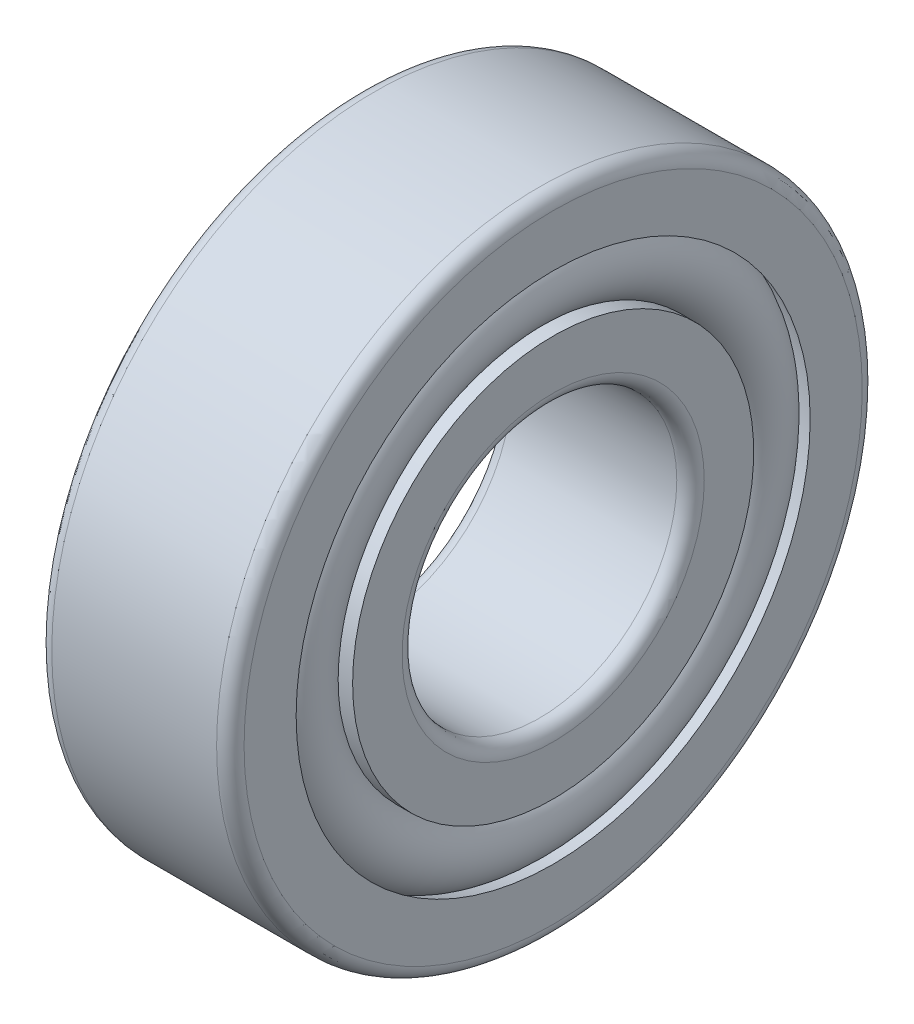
ISO-10303-21;
HEADER;
FILE_DESCRIPTION(('STEP AP214'),'2;1');
FILE_NAME('part.step','',(''),(''),'','','');
FILE_SCHEMA(('AUTOMOTIVE_DESIGN { 1 0 10303 214 1 1 1 1 }'));
ENDSEC;
DATA;
#1=APPLICATION_CONTEXT('core data for automotive mechanical design processes');
#2=APPLICATION_PROTOCOL_DEFINITION('international standard','automotive_design',2000,#1);
#3=PRODUCT_CONTEXT('',#1,'mechanical');
#4=PRODUCT('Part','Part','',(#3));
#5=PRODUCT_RELATED_PRODUCT_CATEGORY('part','',(#4));
#6=PRODUCT_DEFINITION_FORMATION('','',#4);
#7=PRODUCT_DEFINITION_CONTEXT('part definition',#1,'design');
#8=PRODUCT_DEFINITION('design','',#6,#7);
#9=PRODUCT_DEFINITION_SHAPE('','',#8);
#10=(LENGTH_UNIT() NAMED_UNIT(*) SI_UNIT(.MILLI.,.METRE.));
#11=(NAMED_UNIT(*) PLANE_ANGLE_UNIT() SI_UNIT($,.RADIAN.));
#12=(NAMED_UNIT(*) SI_UNIT($,.STERADIAN.) SOLID_ANGLE_UNIT());
#13=UNCERTAINTY_MEASURE_WITH_UNIT(LENGTH_MEASURE(1.E-05),#10,'distance_accuracy_value','');
#14=(GEOMETRIC_REPRESENTATION_CONTEXT(3) GLOBAL_UNCERTAINTY_ASSIGNED_CONTEXT((#13)) GLOBAL_UNIT_ASSIGNED_CONTEXT((#10,
#11,#12)) REPRESENTATION_CONTEXT('',''));
#15=CARTESIAN_POINT('',(0.,0.,0.));
#16=DIRECTION('',(0.,0.,1.));
#17=DIRECTION('',(1.,0.,0.));
#18=AXIS2_PLACEMENT_3D('',#15,#16,#17);
#19=CARTESIAN_POINT('',(1.,0.,0.));
#20=DIRECTION('',(1.,0.,0.));
#21=DIRECTION('',(0.,0.,-1.));
#22=AXIS2_PLACEMENT_3D('',#19,#20,#21);
#23=TOROIDAL_SURFACE('',#22,11.,1.);
#24=CARTESIAN_POINT('',(0.,0.,0.));
#25=DIRECTION('',(-1.,0.,0.));
#26=DIRECTION('',(0.,0.,-1.));
#27=AXIS2_PLACEMENT_3D('',#24,#25,#26);
#28=CIRCLE('',#27,11.);
#29=CARTESIAN_POINT('',(0.,0.,-11.));
#30=VERTEX_POINT('',#29);
#31=EDGE_CURVE('E160',#30,#30,#28,.F.);
#32=ORIENTED_EDGE('',*,*,#31,.F.);
#33=EDGE_LOOP('',(#32));
#34=FACE_BOUND('',#33,.T.);
#35=CARTESIAN_POINT('',(1.,0.,0.));
#36=DIRECTION('',(-1.,0.,0.));
#37=DIRECTION('',(0.,0.,1.));
#38=AXIS2_PLACEMENT_3D('',#35,#36,#37);
#39=CIRCLE('',#38,10.);
#40=CARTESIAN_POINT('',(1.,0.,10.));
#41=VERTEX_POINT('',#40);
#42=EDGE_CURVE('E164',#41,#41,#39,.F.);
#43=ORIENTED_EDGE('',*,*,#42,.T.);
#44=EDGE_LOOP('',(#43));
#45=FACE_BOUND('',#44,.T.);
#46=ADVANCED_FACE('F14',(#34,#45),#23,.T.);
#47=CARTESIAN_POINT('',(13.,0.,0.));
#48=DIRECTION('',(-1.,0.,0.));
#49=DIRECTION('',(0.,0.,1.));
#50=AXIS2_PLACEMENT_3D('',#47,#48,#49);
#51=CYLINDRICAL_SURFACE('',#50,10.);
#52=ORIENTED_EDGE('',*,*,#42,.F.);
#53=EDGE_LOOP('',(#52));
#54=FACE_BOUND('',#53,.T.);
#55=CARTESIAN_POINT('',(13.,0.,0.));
#56=DIRECTION('',(1.,0.,0.));
#57=DIRECTION('',(0.,0.,-1.));
#58=AXIS2_PLACEMENT_3D('',#55,#56,#57);
#59=CIRCLE('',#58,10.);
#60=CARTESIAN_POINT('',(13.,0.,-10.));
#61=VERTEX_POINT('',#60);
#62=EDGE_CURVE('E135',#61,#61,#59,.F.);
#63=ORIENTED_EDGE('',*,*,#62,.F.);
#64=EDGE_LOOP('',(#63));
#65=FACE_BOUND('',#64,.T.);
#66=ADVANCED_FACE('F179',(#54,#65),#51,.F.);
#67=CARTESIAN_POINT('',(0.,14.6,0.));
#68=DIRECTION('',(-1.,0.,0.));
#69=DIRECTION('',(0.,0.,1.));
#70=AXIS2_PLACEMENT_3D('',#67,#68,#69);
#71=PLANE('',#70);
#72=CARTESIAN_POINT('',(0.,0.,0.));
#73=DIRECTION('',(-1.,0.,0.));
#74=DIRECTION('',(0.,0.,1.));
#75=AXIS2_PLACEMENT_3D('',#72,#73,#74);
#76=CIRCLE('',#75,14.6);
#77=CARTESIAN_POINT('',(0.,0.,14.6));
#78=VERTEX_POINT('',#77);
#79=EDGE_CURVE('E18',#78,#78,#76,.F.);
#80=ORIENTED_EDGE('',*,*,#79,.F.);
#81=EDGE_LOOP('',(#80));
#82=FACE_BOUND('',#81,.T.);
#83=ORIENTED_EDGE('',*,*,#31,.T.);
#84=EDGE_LOOP('',(#83));
#85=FACE_BOUND('',#84,.T.);
#86=ADVANCED_FACE('F141',(#82,#85),#71,.T.);
#87=CARTESIAN_POINT('',(13.,0.,0.));
#88=DIRECTION('',(1.,0.,0.));
#89=DIRECTION('',(0.,0.,-1.));
#90=AXIS2_PLACEMENT_3D('',#87,#88,#89);
#91=TOROIDAL_SURFACE('',#90,11.,1.);
#92=ORIENTED_EDGE('',*,*,#62,.T.);
#93=EDGE_LOOP('',(#92));
#94=FACE_BOUND('',#93,.T.);
#95=CARTESIAN_POINT('',(14.,0.,0.));
#96=DIRECTION('',(1.,0.,0.));
#97=DIRECTION('',(0.,0.,-1.));
#98=AXIS2_PLACEMENT_3D('',#95,#96,#97);
#99=CIRCLE('',#98,11.);
#100=CARTESIAN_POINT('',(14.,0.,-11.));
#101=VERTEX_POINT('',#100);
#102=EDGE_CURVE('E204',#101,#101,#99,.F.);
#103=ORIENTED_EDGE('',*,*,#102,.F.);
#104=EDGE_LOOP('',(#103));
#105=FACE_BOUND('',#104,.T.);
#106=ADVANCED_FACE('F137',(#94,#105),#91,.T.);
#107=CARTESIAN_POINT('',(13.,0.,0.));
#108=DIRECTION('',(-1.,0.,0.));
#109=DIRECTION('',(0.,0.,1.));
#110=AXIS2_PLACEMENT_3D('',#107,#108,#109);
#111=CYLINDRICAL_SURFACE('',#110,14.6);
#112=CARTESIAN_POINT('',(1.10399999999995,0.,0.));
#113=DIRECTION('',(1.,0.,0.));
#114=DIRECTION('',(0.,0.,-1.));
#115=AXIS2_PLACEMENT_3D('',#112,#113,#114);
#116=CIRCLE('',#115,14.6);
#117=CARTESIAN_POINT('',(1.10399999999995,0.,-14.6));
#118=VERTEX_POINT('',#117);
#119=EDGE_CURVE('E107',#118,#118,#116,.T.);
#120=ORIENTED_EDGE('',*,*,#119,.F.);
#121=EDGE_LOOP('',(#120));
#122=FACE_BOUND('',#121,.T.);
#123=ORIENTED_EDGE('',*,*,#79,.T.);
#124=EDGE_LOOP('',(#123));
#125=FACE_BOUND('',#124,.T.);
#126=ADVANCED_FACE('F119',(#122,#125),#111,.T.);
#127=CARTESIAN_POINT('',(14.,11.,0.));
#128=DIRECTION('',(1.,0.,0.));
#129=DIRECTION('',(0.,0.,-1.));
#130=AXIS2_PLACEMENT_3D('',#127,#128,#129);
#131=PLANE('',#130);
#132=ORIENTED_EDGE('',*,*,#102,.T.);
#133=EDGE_LOOP('',(#132));
#134=FACE_BOUND('',#133,.T.);
#135=CARTESIAN_POINT('',(14.,0.,0.));
#136=DIRECTION('',(-1.,0.,0.));
#137=DIRECTION('',(0.,0.,1.));
#138=AXIS2_PLACEMENT_3D('',#135,#136,#137);
#139=CIRCLE('',#138,14.6);
#140=CARTESIAN_POINT('',(14.,0.,14.6));
#141=VERTEX_POINT('',#140);
#142=EDGE_CURVE('E199',#141,#141,#139,.T.);
#143=ORIENTED_EDGE('',*,*,#142,.F.);
#144=EDGE_LOOP('',(#143));
#145=FACE_BOUND('',#144,.T.);
#146=ADVANCED_FACE('F114',(#134,#145),#131,.T.);
#147=CARTESIAN_POINT('',(2.6646712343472,0.,0.));
#148=DIRECTION('',(1.,0.,0.));
#149=DIRECTION('',(0.,0.,-1.));
#150=AXIS2_PLACEMENT_3D('',#147,#148,#149);
#151=TOROIDAL_SURFACE('',#150,16.7602153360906,2.665);
#152=CARTESIAN_POINT('',(1.514,0.,0.));
#153=DIRECTION('',(1.,0.,0.));
#154=DIRECTION('',(0.,0.,-1.));
#155=AXIS2_PLACEMENT_3D('',#152,#153,#154);
#156=CIRCLE('',#155,19.164);
#157=CARTESIAN_POINT('',(1.514,0.,-19.164));
#158=VERTEX_POINT('',#157);
#159=EDGE_CURVE('E102',#158,#158,#156,.T.);
#160=ORIENTED_EDGE('',*,*,#159,.F.);
#161=EDGE_LOOP('',(#160));
#162=FACE_BOUND('',#161,.T.);
#163=ORIENTED_EDGE('',*,*,#119,.T.);
#164=EDGE_LOOP('',(#163));
#165=FACE_BOUND('',#164,.T.);
#166=ADVANCED_FACE('F110',(#162,#165),#151,.T.);
#167=CARTESIAN_POINT('',(13.,0.,0.));
#168=DIRECTION('',(-1.,0.,0.));
#169=DIRECTION('',(0.,0.,1.));
#170=AXIS2_PLACEMENT_3D('',#167,#168,#169);
#171=CYLINDRICAL_SURFACE('',#170,14.6);
#172=ORIENTED_EDGE('',*,*,#142,.T.);
#173=EDGE_LOOP('',(#172));
#174=FACE_BOUND('',#173,.T.);
#175=CARTESIAN_POINT('',(12.895,0.,0.));
#176=DIRECTION('',(1.,0.,0.));
#177=DIRECTION('',(0.,0.,-1.));
#178=AXIS2_PLACEMENT_3D('',#175,#176,#177);
#179=CIRCLE('',#178,14.6);
#180=CARTESIAN_POINT('',(12.895,0.,-14.6));
#181=VERTEX_POINT('',#180);
#182=EDGE_CURVE('E98',#181,#181,#179,.F.);
#183=ORIENTED_EDGE('',*,*,#182,.F.);
#184=EDGE_LOOP('',(#183));
#185=FACE_BOUND('',#184,.T.);
#186=ADVANCED_FACE('F113',(#174,#185),#171,.T.);
#187=CARTESIAN_POINT('',(1.514,19.209,0.));
#188=DIRECTION('',(-1.,0.,0.));
#189=DIRECTION('',(0.,0.,1.));
#190=AXIS2_PLACEMENT_3D('',#187,#188,#189);
#191=PLANE('',#190);
#192=CARTESIAN_POINT('',(1.514,0.,0.));
#193=DIRECTION('',(1.,0.,0.));
#194=DIRECTION('',(0.,0.,-1.));
#195=AXIS2_PLACEMENT_3D('',#192,#193,#194);
#196=CIRCLE('',#195,19.209);
#197=CARTESIAN_POINT('',(1.514,0.,-19.209));
#198=VERTEX_POINT('',#197);
#199=EDGE_CURVE('E101',#198,#198,#196,.F.);
#200=ORIENTED_EDGE('',*,*,#199,.T.);
#201=EDGE_LOOP('',(#200));
#202=FACE_BOUND('',#201,.T.);
#203=ORIENTED_EDGE('',*,*,#159,.T.);
#204=EDGE_LOOP('',(#203));
#205=FACE_BOUND('',#204,.T.);
#206=ADVANCED_FACE('F90',(#202,#205),#191,.T.);
#207=CARTESIAN_POINT('',(11.3549185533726,0.,0.));
#208=DIRECTION('',(1.,0.,0.));
#209=DIRECTION('',(0.,0.,-1.));
#210=AXIS2_PLACEMENT_3D('',#207,#208,#209);
#211=TOROIDAL_SURFACE('',#210,16.7749423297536,2.665);
#212=ORIENTED_EDGE('',*,*,#182,.T.);
#213=EDGE_LOOP('',(#212));
#214=FACE_BOUND('',#213,.T.);
#215=CARTESIAN_POINT('',(12.3479999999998,0.,0.));
#216=DIRECTION('',(-1.,0.,0.));
#217=DIRECTION('',(0.,0.,1.));
#218=AXIS2_PLACEMENT_3D('',#215,#216,#217);
#219=CIRCLE('',#218,19.248);
#220=CARTESIAN_POINT('',(12.3479999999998,0.,19.248));
#221=VERTEX_POINT('',#220);
#222=EDGE_CURVE('E195',#221,#221,#219,.F.);
#223=ORIENTED_EDGE('',*,*,#222,.T.);
#224=EDGE_LOOP('',(#223));
#225=FACE_BOUND('',#224,.T.);
#226=ADVANCED_FACE('F86',(#214,#225),#211,.T.);
#227=CARTESIAN_POINT('',(7.00535497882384,0.,0.));
#228=DIRECTION('',(1.,0.,0.));
#229=DIRECTION('',(0.,0.,-1.));
#230=AXIS2_PLACEMENT_3D('',#227,#228,#229);
#231=DEGENERATE_TOROIDAL_SURFACE('',#230,0.00156525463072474,19.9770000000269,.T.);
#232=ORIENTED_EDGE('',*,*,#199,.F.);
#233=EDGE_LOOP('',(#232));
#234=FACE_BOUND('',#233,.T.);
#235=CARTESIAN_POINT('',(0.,0.,0.));
#236=DIRECTION('',(1.,0.,0.));
#237=DIRECTION('',(0.,0.,-1.));
#238=AXIS2_PLACEMENT_3D('',#235,#236,#237);
#239=CIRCLE('',#238,18.71);
#240=CARTESIAN_POINT('',(0.,0.,-18.71));
#241=VERTEX_POINT('',#240);
#242=EDGE_CURVE('E192',#241,#241,#239,.T.);
#243=ORIENTED_EDGE('',*,*,#242,.F.);
#244=EDGE_LOOP('',(#243));
#245=FACE_BOUND('',#244,.T.);
#246=ADVANCED_FACE('F16',(#234,#245),#231,.F.);
#247=CARTESIAN_POINT('',(12.3479999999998,0.,0.));
#248=DIRECTION('',(-1.,0.,0.));
#249=DIRECTION('',(0.,-1.,0.));
#250=AXIS2_PLACEMENT_3D('',#247,#248,#249);
#251=CONICAL_SURFACE('',#250,19.248,0.314834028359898);
#252=ORIENTED_EDGE('',*,*,#222,.F.);
#253=EDGE_LOOP('',(#252));
#254=FACE_BOUND('',#253,.T.);
#255=CARTESIAN_POINT('',(14.,0.,0.));
#256=DIRECTION('',(-1.,0.,0.));
#257=DIRECTION('',(0.,-1.,0.));
#258=AXIS2_PLACEMENT_3D('',#255,#256,#257);
#259=CIRCLE('',#258,18.71);
#260=CARTESIAN_POINT('',(14.,-18.71,0.));
#261=VERTEX_POINT('',#260);
#262=EDGE_CURVE('E184',#261,#261,#259,.T.);
#263=ORIENTED_EDGE('',*,*,#262,.F.);
#264=EDGE_LOOP('',(#263));
#265=FACE_BOUND('',#264,.T.);
#266=ADVANCED_FACE('F81',(#254,#265),#251,.F.);
#267=CARTESIAN_POINT('',(0.,22.5,0.));
#268=DIRECTION('',(-1.,0.,0.));
#269=DIRECTION('',(0.,0.,1.));
#270=AXIS2_PLACEMENT_3D('',#267,#268,#269);
#271=PLANE('',#270);
#272=CARTESIAN_POINT('',(0.,0.,0.));
#273=DIRECTION('',(1.,0.,0.));
#274=DIRECTION('',(0.,0.,-1.));
#275=AXIS2_PLACEMENT_3D('',#272,#273,#274);
#276=CIRCLE('',#275,22.5);
#277=CARTESIAN_POINT('',(0.,0.,-22.5));
#278=VERTEX_POINT('',#277);
#279=EDGE_CURVE('E65',#278,#278,#276,.T.);
#280=ORIENTED_EDGE('',*,*,#279,.F.);
#281=EDGE_LOOP('',(#280));
#282=FACE_BOUND('',#281,.T.);
#283=ORIENTED_EDGE('',*,*,#242,.T.);
#284=EDGE_LOOP('',(#283));
#285=FACE_BOUND('',#284,.T.);
#286=ADVANCED_FACE('F71',(#282,#285),#271,.T.);
#287=CARTESIAN_POINT('',(14.,18.71,0.));
#288=DIRECTION('',(1.,0.,0.));
#289=DIRECTION('',(0.,0.,-1.));
#290=AXIS2_PLACEMENT_3D('',#287,#288,#289);
#291=PLANE('',#290);
#292=ORIENTED_EDGE('',*,*,#262,.T.);
#293=EDGE_LOOP('',(#292));
#294=FACE_BOUND('',#293,.T.);
#295=CARTESIAN_POINT('',(14.,0.,0.));
#296=DIRECTION('',(-1.,0.,0.));
#297=DIRECTION('',(0.,0.,-1.));
#298=AXIS2_PLACEMENT_3D('',#295,#296,#297);
#299=CIRCLE('',#298,22.5);
#300=CARTESIAN_POINT('',(14.,0.,-22.5));
#301=VERTEX_POINT('',#300);
#302=EDGE_CURVE('E27',#301,#301,#299,.T.);
#303=ORIENTED_EDGE('',*,*,#302,.F.);
#304=EDGE_LOOP('',(#303));
#305=FACE_BOUND('',#304,.T.);
#306=ADVANCED_FACE('F80',(#294,#305),#291,.T.);
#307=CARTESIAN_POINT('',(1.,0.,0.));
#308=DIRECTION('',(1.,0.,0.));
#309=DIRECTION('',(0.,0.,-1.));
#310=AXIS2_PLACEMENT_3D('',#307,#308,#309);
#311=TOROIDAL_SURFACE('',#310,22.5,1.);
#312=CARTESIAN_POINT('',(1.,0.,0.));
#313=DIRECTION('',(-1.,0.,0.));
#314=DIRECTION('',(0.,0.,1.));
#315=AXIS2_PLACEMENT_3D('',#312,#313,#314);
#316=CIRCLE('',#315,23.5);
#317=CARTESIAN_POINT('',(1.,0.,23.5));
#318=VERTEX_POINT('',#317);
#319=EDGE_CURVE('E22',#318,#318,#316,.F.);
#320=ORIENTED_EDGE('',*,*,#319,.F.);
#321=EDGE_LOOP('',(#320));
#322=FACE_BOUND('',#321,.T.);
#323=ORIENTED_EDGE('',*,*,#279,.T.);
#324=EDGE_LOOP('',(#323));
#325=FACE_BOUND('',#324,.T.);
#326=ADVANCED_FACE('F45',(#322,#325),#311,.T.);
#327=CARTESIAN_POINT('',(13.,0.,0.));
#328=DIRECTION('',(1.,0.,0.));
#329=DIRECTION('',(0.,0.,-1.));
#330=AXIS2_PLACEMENT_3D('',#327,#328,#329);
#331=TOROIDAL_SURFACE('',#330,22.5,1.);
#332=ORIENTED_EDGE('',*,*,#302,.T.);
#333=EDGE_LOOP('',(#332));
#334=FACE_BOUND('',#333,.T.);
#335=CARTESIAN_POINT('',(13.,0.,0.));
#336=DIRECTION('',(-1.,0.,0.));
#337=DIRECTION('',(0.,0.,1.));
#338=AXIS2_PLACEMENT_3D('',#335,#336,#337);
#339=CIRCLE('',#338,23.5);
#340=CARTESIAN_POINT('',(13.,0.,23.5));
#341=VERTEX_POINT('',#340);
#342=EDGE_CURVE('E10',#341,#341,#339,.T.);
#343=ORIENTED_EDGE('',*,*,#342,.F.);
#344=EDGE_LOOP('',(#343));
#345=FACE_BOUND('',#344,.T.);
#346=ADVANCED_FACE('F39',(#334,#345),#331,.T.);
#347=CARTESIAN_POINT('',(13.,0.,0.));
#348=DIRECTION('',(-1.,0.,0.));
#349=DIRECTION('',(0.,0.,1.));
#350=AXIS2_PLACEMENT_3D('',#347,#348,#349);
#351=CYLINDRICAL_SURFACE('',#350,23.5);
#352=ORIENTED_EDGE('',*,*,#342,.T.);
#353=EDGE_LOOP('',(#352));
#354=FACE_BOUND('',#353,.T.);
#355=ORIENTED_EDGE('',*,*,#319,.T.);
#356=EDGE_LOOP('',(#355));
#357=FACE_BOUND('',#356,.T.);
#358=ADVANCED_FACE('F44',(#354,#357),#351,.T.);
#359=CLOSED_SHELL('',(#46,#66,#86,#106,#126,#146,#166,#186,#206,#226,#246,#266,#286,#306,#326,
#346,#358));
#360=MANIFOLD_SOLID_BREP('B1',#359);
#361=ADVANCED_BREP_SHAPE_REPRESENTATION('',(#18,#360),#14);
#362=SHAPE_DEFINITION_REPRESENTATION(#9,#361);
ENDSEC;
END-ISO-10303-21;
